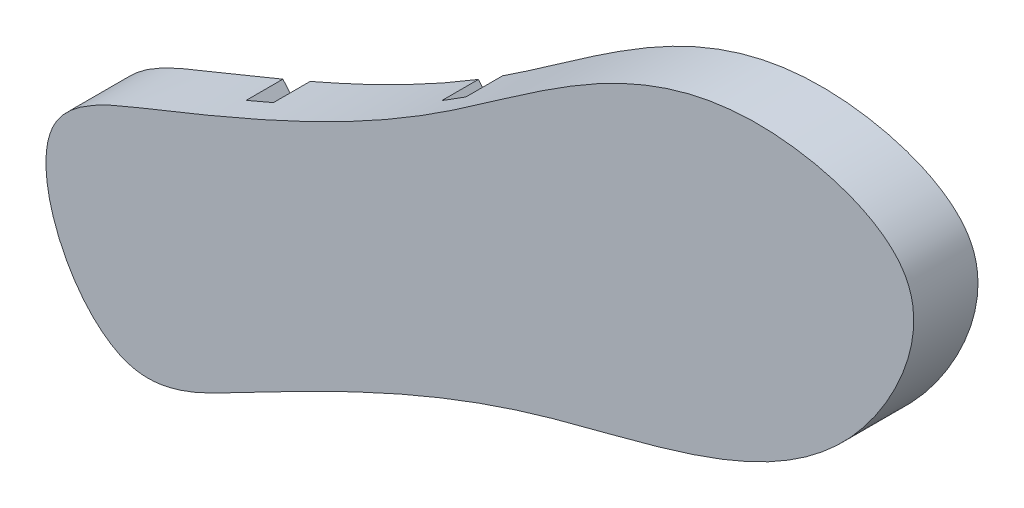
from build123d import *

# Parameters (mm, degrees)
GOMA_START         = 12.5
GOMA_DEPTH         = 3.5
RANURAS_AGUA_DEPTH = 2


with BuildPart() as part:
    # Sk_Goma → Goma (new body)
    with BuildSketch(Plane.XY.offset(GOMA_START)):
        with BuildLine():
            add(Edge.make_bspline(
                [(431.734976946, 343.776693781), (432.52405624, 345.528087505), (441.146604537, 348.888155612), (453.620501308, 354.288763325), (465.962705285, 365.603111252), (480.557784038, 360.803442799), (474.741212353, 346.583012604), (458.123888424, 344.531424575), (445.921336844, 338.54290228), (434.386282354, 332.342242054), (430.437738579, 340.897420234), (431.734976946, 343.776693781)],
                knots=[0, 0, 0, 0, 0.053449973, 0.211657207, 0.387434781, 0.456064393, 0.524694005, 0.700471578, 0.858678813, 0.912128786, 1, 1, 1, 1], degree=3))
        make_face()
    extrude(amount=GOMA_DEPTH)

    # Sk_Ranuras_agua → Ranuras_agua (cut)
    with BuildSketch(Plane.XY.offset(12.5)):
        Polygon((439.976454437, 349.783194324), (441.429189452, 350.453687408), (450.927841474, 339.418488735), (449.475106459, 338.747995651), align=None)
        Polygon((450.871967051, 354.811892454), (452.324702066, 355.482385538), (461.823354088, 344.447186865), (460.370619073, 343.776693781), align=None)
        Polygon((461.767479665, 359.840590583), (463.22021468, 360.511083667), (472.718866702, 349.475884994), (471.266131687, 348.80539191), align=None)
    extrude(amount=RANURAS_AGUA_DEPTH, mode=Mode.SUBTRACT)


solid = part.part
